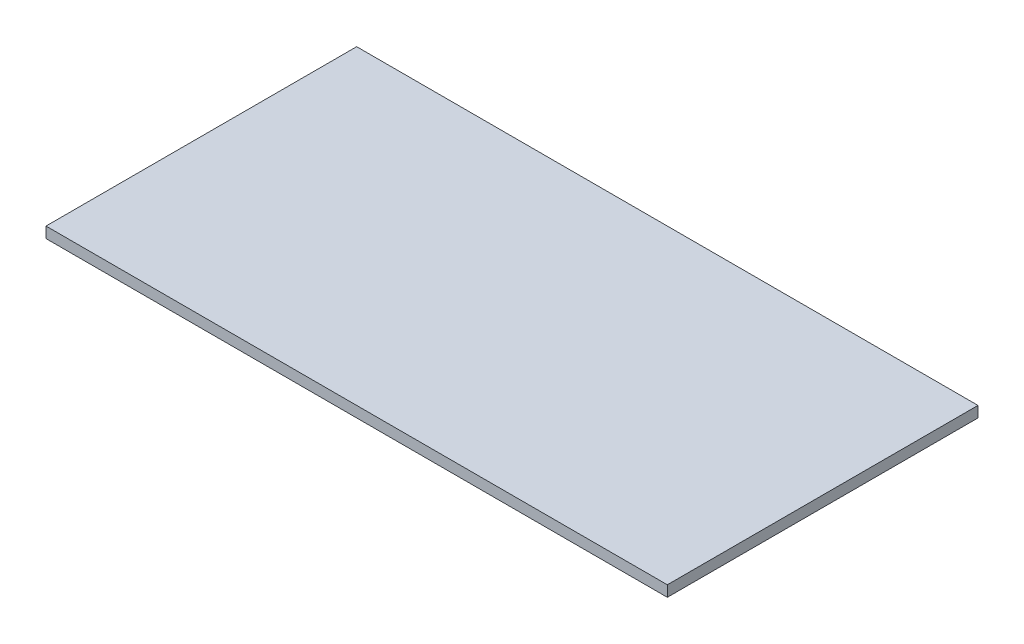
ISO-10303-21;
HEADER;
FILE_DESCRIPTION(('STEP AP214'),'2;1');
FILE_NAME('part.step','',(''),(''),'','','');
FILE_SCHEMA(('AUTOMOTIVE_DESIGN { 1 0 10303 214 1 1 1 1 }'));
ENDSEC;
DATA;
#1=APPLICATION_CONTEXT('core data for automotive mechanical design processes');
#2=APPLICATION_PROTOCOL_DEFINITION('international standard','automotive_design',2000,#1);
#3=PRODUCT_CONTEXT('',#1,'mechanical');
#4=PRODUCT('Part','Part','',(#3));
#5=PRODUCT_RELATED_PRODUCT_CATEGORY('part','',(#4));
#6=PRODUCT_DEFINITION_FORMATION('','',#4);
#7=PRODUCT_DEFINITION_CONTEXT('part definition',#1,'design');
#8=PRODUCT_DEFINITION('design','',#6,#7);
#9=PRODUCT_DEFINITION_SHAPE('','',#8);
#10=(LENGTH_UNIT() NAMED_UNIT(*) SI_UNIT(.MILLI.,.METRE.));
#11=(NAMED_UNIT(*) PLANE_ANGLE_UNIT() SI_UNIT($,.RADIAN.));
#12=(NAMED_UNIT(*) SI_UNIT($,.STERADIAN.) SOLID_ANGLE_UNIT());
#13=UNCERTAINTY_MEASURE_WITH_UNIT(LENGTH_MEASURE(1.E-05),#10,'distance_accuracy_value','');
#14=(GEOMETRIC_REPRESENTATION_CONTEXT(3) GLOBAL_UNCERTAINTY_ASSIGNED_CONTEXT((#13)) GLOBAL_UNIT_ASSIGNED_CONTEXT((#10,
#11,#12)) REPRESENTATION_CONTEXT('',''));
#15=CARTESIAN_POINT('',(0.,0.,0.));
#16=DIRECTION('',(0.,0.,1.));
#17=DIRECTION('',(1.,0.,0.));
#18=AXIS2_PLACEMENT_3D('',#15,#16,#17);
#19=CARTESIAN_POINT('',(-800.,28.,-400.));
#20=DIRECTION('',(1.,0.,0.));
#21=DIRECTION('',(0.,0.,-1.));
#22=AXIS2_PLACEMENT_3D('',#19,#20,#21);
#23=PLANE('',#22);
#24=DIRECTION('',(0.,0.,1.));
#25=VECTOR('',#24,1.);
#26=CARTESIAN_POINT('',(-800.,0.,-400.));
#27=LINE('',#26,#25);
#28=CARTESIAN_POINT('',(-800.,0.,-400.));
#29=VERTEX_POINT('',#28);
#30=CARTESIAN_POINT('',(-800.,0.,400.));
#31=VERTEX_POINT('',#30);
#32=EDGE_CURVE('E290',#29,#31,#27,.T.);
#33=ORIENTED_EDGE('',*,*,#32,.T.);
#34=DIRECTION('',(0.,-1.,0.));
#35=VECTOR('',#34,1.);
#36=CARTESIAN_POINT('',(-800.,28.,400.));
#37=LINE('',#36,#35);
#38=CARTESIAN_POINT('',(-800.,28.,400.));
#39=VERTEX_POINT('',#38);
#40=EDGE_CURVE('E11',#39,#31,#37,.T.);
#41=ORIENTED_EDGE('',*,*,#40,.F.);
#42=DIRECTION('',(0.,0.,1.));
#43=VECTOR('',#42,1.);
#44=CARTESIAN_POINT('',(-800.,28.,-400.));
#45=LINE('',#44,#43);
#46=CARTESIAN_POINT('',(-800.,28.,-400.));
#47=VERTEX_POINT('',#46);
#48=EDGE_CURVE('E291',#47,#39,#45,.T.);
#49=ORIENTED_EDGE('',*,*,#48,.F.);
#50=DIRECTION('',(0.,-1.,0.));
#51=VECTOR('',#50,1.);
#52=CARTESIAN_POINT('',(-800.,28.,-400.));
#53=LINE('',#52,#51);
#54=EDGE_CURVE('E297',#47,#29,#53,.T.);
#55=ORIENTED_EDGE('',*,*,#54,.T.);
#56=EDGE_LOOP('',(#33,#41,#49,#55));
#57=FACE_BOUND('',#56,.T.);
#58=ADVANCED_FACE('F42',(#57),#23,.F.);
#59=CARTESIAN_POINT('',(-800.,28.,400.));
#60=DIRECTION('',(0.,0.,-1.));
#61=DIRECTION('',(-1.,0.,0.));
#62=AXIS2_PLACEMENT_3D('',#59,#60,#61);
#63=PLANE('',#62);
#64=DIRECTION('',(1.,0.,0.));
#65=VECTOR('',#64,1.);
#66=CARTESIAN_POINT('',(-800.,0.,400.));
#67=LINE('',#66,#65);
#68=CARTESIAN_POINT('',(800.,0.,400.));
#69=VERTEX_POINT('',#68);
#70=EDGE_CURVE('E300',#31,#69,#67,.T.);
#71=ORIENTED_EDGE('',*,*,#70,.T.);
#72=DIRECTION('',(0.,-1.,0.));
#73=VECTOR('',#72,1.);
#74=CARTESIAN_POINT('',(800.,28.,400.));
#75=LINE('',#74,#73);
#76=CARTESIAN_POINT('',(800.,28.,400.));
#77=VERTEX_POINT('',#76);
#78=EDGE_CURVE('E50',#77,#69,#75,.T.);
#79=ORIENTED_EDGE('',*,*,#78,.F.);
#80=DIRECTION('',(1.,0.,0.));
#81=VECTOR('',#80,1.);
#82=CARTESIAN_POINT('',(-800.,28.,400.));
#83=LINE('',#82,#81);
#84=EDGE_CURVE('E89',#39,#77,#83,.T.);
#85=ORIENTED_EDGE('',*,*,#84,.F.);
#86=ORIENTED_EDGE('',*,*,#40,.T.);
#87=EDGE_LOOP('',(#71,#79,#85,#86));
#88=FACE_BOUND('',#87,.T.);
#89=ADVANCED_FACE('F323',(#88),#63,.F.);
#90=CARTESIAN_POINT('',(800.,28.,-400.));
#91=DIRECTION('',(-1.,0.,0.));
#92=DIRECTION('',(0.,0.,1.));
#93=AXIS2_PLACEMENT_3D('',#90,#91,#92);
#94=PLANE('',#93);
#95=DIRECTION('',(0.,0.,-1.));
#96=VECTOR('',#95,1.);
#97=CARTESIAN_POINT('',(800.,0.,-400.));
#98=LINE('',#97,#96);
#99=CARTESIAN_POINT('',(800.,0.,-400.));
#100=VERTEX_POINT('',#99);
#101=EDGE_CURVE('E76',#69,#100,#98,.T.);
#102=ORIENTED_EDGE('',*,*,#101,.T.);
#103=DIRECTION('',(0.,-1.,0.));
#104=VECTOR('',#103,1.);
#105=CARTESIAN_POINT('',(800.,28.,-400.));
#106=LINE('',#105,#104);
#107=CARTESIAN_POINT('',(800.,28.,-400.));
#108=VERTEX_POINT('',#107);
#109=EDGE_CURVE('E305',#108,#100,#106,.T.);
#110=ORIENTED_EDGE('',*,*,#109,.F.);
#111=DIRECTION('',(0.,0.,-1.));
#112=VECTOR('',#111,1.);
#113=CARTESIAN_POINT('',(800.,28.,-400.));
#114=LINE('',#113,#112);
#115=EDGE_CURVE('E294',#77,#108,#114,.T.);
#116=ORIENTED_EDGE('',*,*,#115,.F.);
#117=ORIENTED_EDGE('',*,*,#78,.T.);
#118=EDGE_LOOP('',(#102,#110,#116,#117));
#119=FACE_BOUND('',#118,.T.);
#120=ADVANCED_FACE('F307',(#119),#94,.F.);
#121=CARTESIAN_POINT('',(-800.,28.,-400.));
#122=DIRECTION('',(0.,0.,1.));
#123=DIRECTION('',(1.,0.,0.));
#124=AXIS2_PLACEMENT_3D('',#121,#122,#123);
#125=PLANE('',#124);
#126=DIRECTION('',(-1.,0.,0.));
#127=VECTOR('',#126,1.);
#128=CARTESIAN_POINT('',(-800.,0.,-400.));
#129=LINE('',#128,#127);
#130=EDGE_CURVE('E82',#100,#29,#129,.T.);
#131=ORIENTED_EDGE('',*,*,#130,.T.);
#132=ORIENTED_EDGE('',*,*,#54,.F.);
#133=DIRECTION('',(-1.,0.,0.));
#134=VECTOR('',#133,1.);
#135=CARTESIAN_POINT('',(-800.,28.,-400.));
#136=LINE('',#135,#134);
#137=EDGE_CURVE('E58',#108,#47,#136,.T.);
#138=ORIENTED_EDGE('',*,*,#137,.F.);
#139=ORIENTED_EDGE('',*,*,#109,.T.);
#140=EDGE_LOOP('',(#131,#132,#138,#139));
#141=FACE_BOUND('',#140,.T.);
#142=ADVANCED_FACE('F314',(#141),#125,.F.);
#143=CARTESIAN_POINT('',(0.,28.,0.));
#144=DIRECTION('',(0.,1.,0.));
#145=DIRECTION('',(0.,0.,1.));
#146=AXIS2_PLACEMENT_3D('',#143,#144,#145);
#147=PLANE('',#146);
#148=ORIENTED_EDGE('',*,*,#48,.T.);
#149=ORIENTED_EDGE('',*,*,#84,.T.);
#150=ORIENTED_EDGE('',*,*,#115,.T.);
#151=ORIENTED_EDGE('',*,*,#137,.T.);
#152=EDGE_LOOP('',(#148,#149,#150,#151));
#153=FACE_BOUND('',#152,.T.);
#154=ADVANCED_FACE('F316',(#153),#147,.T.);
#155=CARTESIAN_POINT('',(0.,0.,0.));
#156=DIRECTION('',(0.,1.,0.));
#157=DIRECTION('',(0.,0.,1.));
#158=AXIS2_PLACEMENT_3D('',#155,#156,#157);
#159=PLANE('',#158);
#160=CARTESIAN_POINT('',(-750.,0.,350.));
#161=DIRECTION('',(0.,-1.,0.));
#162=DIRECTION('',(0.,0.,-1.));
#163=AXIS2_PLACEMENT_3D('',#160,#161,#162);
#164=CIRCLE('',#163,6.49999999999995);
#165=CARTESIAN_POINT('',(-750.,0.,343.5));
#166=VERTEX_POINT('',#165);
#167=EDGE_CURVE('E155',#166,#166,#164,.T.);
#168=ORIENTED_EDGE('',*,*,#167,.F.);
#169=EDGE_LOOP('',(#168));
#170=FACE_BOUND('',#169,.T.);
#171=CARTESIAN_POINT('',(-750.,0.,50.));
#172=DIRECTION('',(0.,-1.,0.));
#173=DIRECTION('',(0.,0.,-1.));
#174=AXIS2_PLACEMENT_3D('',#171,#172,#173);
#175=CIRCLE('',#174,6.49999999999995);
#176=CARTESIAN_POINT('',(-750.,0.,43.5));
#177=VERTEX_POINT('',#176);
#178=EDGE_CURVE('E148',#177,#177,#175,.T.);
#179=ORIENTED_EDGE('',*,*,#178,.F.);
#180=EDGE_LOOP('',(#179));
#181=FACE_BOUND('',#180,.T.);
#182=CARTESIAN_POINT('',(-650.,0.,350.));
#183=DIRECTION('',(0.,-1.,0.));
#184=DIRECTION('',(0.,0.,-1.));
#185=AXIS2_PLACEMENT_3D('',#182,#183,#184);
#186=CIRCLE('',#185,6.49999999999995);
#187=CARTESIAN_POINT('',(-650.,0.,343.5));
#188=VERTEX_POINT('',#187);
#189=EDGE_CURVE('E164',#188,#188,#186,.T.);
#190=ORIENTED_EDGE('',*,*,#189,.F.);
#191=EDGE_LOOP('',(#190));
#192=FACE_BOUND('',#191,.T.);
#193=CARTESIAN_POINT('',(-650.,0.,50.));
#194=DIRECTION('',(0.,-1.,0.));
#195=DIRECTION('',(0.,0.,-1.));
#196=AXIS2_PLACEMENT_3D('',#193,#194,#195);
#197=CIRCLE('',#196,6.49999999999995);
#198=CARTESIAN_POINT('',(-650.,0.,43.5));
#199=VERTEX_POINT('',#198);
#200=EDGE_CURVE('E173',#199,#199,#197,.T.);
#201=ORIENTED_EDGE('',*,*,#200,.F.);
#202=EDGE_LOOP('',(#201));
#203=FACE_BOUND('',#202,.T.);
#204=CARTESIAN_POINT('',(-650.,0.,-50.));
#205=DIRECTION('',(0.,-1.,0.));
#206=DIRECTION('',(0.,0.,-1.));
#207=AXIS2_PLACEMENT_3D('',#204,#205,#206);
#208=CIRCLE('',#207,6.49999999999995);
#209=CARTESIAN_POINT('',(-650.,0.,-56.4999999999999));
#210=VERTEX_POINT('',#209);
#211=EDGE_CURVE('E182',#210,#210,#208,.T.);
#212=ORIENTED_EDGE('',*,*,#211,.F.);
#213=EDGE_LOOP('',(#212));
#214=FACE_BOUND('',#213,.T.);
#215=CARTESIAN_POINT('',(-650.,0.,-350.));
#216=DIRECTION('',(0.,-1.,0.));
#217=DIRECTION('',(0.,0.,-1.));
#218=AXIS2_PLACEMENT_3D('',#215,#216,#217);
#219=CIRCLE('',#218,6.49999999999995);
#220=CARTESIAN_POINT('',(-650.,0.,-356.5));
#221=VERTEX_POINT('',#220);
#222=EDGE_CURVE('E191',#221,#221,#219,.T.);
#223=ORIENTED_EDGE('',*,*,#222,.F.);
#224=EDGE_LOOP('',(#223));
#225=FACE_BOUND('',#224,.T.);
#226=CARTESIAN_POINT('',(-750.,0.,-50.));
#227=DIRECTION('',(0.,-1.,0.));
#228=DIRECTION('',(0.,0.,-1.));
#229=AXIS2_PLACEMENT_3D('',#226,#227,#228);
#230=CIRCLE('',#229,6.49999999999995);
#231=CARTESIAN_POINT('',(-750.,0.,-56.4999999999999));
#232=VERTEX_POINT('',#231);
#233=EDGE_CURVE('E200',#232,#232,#230,.T.);
#234=ORIENTED_EDGE('',*,*,#233,.F.);
#235=EDGE_LOOP('',(#234));
#236=FACE_BOUND('',#235,.T.);
#237=CARTESIAN_POINT('',(-750.,0.,-350.));
#238=DIRECTION('',(0.,-1.,0.));
#239=DIRECTION('',(0.,0.,-1.));
#240=AXIS2_PLACEMENT_3D('',#237,#238,#239);
#241=CIRCLE('',#240,6.49999999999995);
#242=CARTESIAN_POINT('',(-750.,0.,-356.5));
#243=VERTEX_POINT('',#242);
#244=EDGE_CURVE('E209',#243,#243,#241,.T.);
#245=ORIENTED_EDGE('',*,*,#244,.F.);
#246=EDGE_LOOP('',(#245));
#247=FACE_BOUND('',#246,.T.);
#248=CARTESIAN_POINT('',(750.,0.,350.));
#249=DIRECTION('',(0.,-1.,0.));
#250=DIRECTION('',(0.,0.,-1.));
#251=AXIS2_PLACEMENT_3D('',#248,#249,#250);
#252=CIRCLE('',#251,6.49999999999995);
#253=CARTESIAN_POINT('',(750.,0.,343.5));
#254=VERTEX_POINT('',#253);
#255=EDGE_CURVE('E218',#254,#254,#252,.T.);
#256=ORIENTED_EDGE('',*,*,#255,.F.);
#257=EDGE_LOOP('',(#256));
#258=FACE_BOUND('',#257,.T.);
#259=CARTESIAN_POINT('',(750.,0.,50.));
#260=DIRECTION('',(0.,-1.,0.));
#261=DIRECTION('',(0.,0.,-1.));
#262=AXIS2_PLACEMENT_3D('',#259,#260,#261);
#263=CIRCLE('',#262,6.49999999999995);
#264=CARTESIAN_POINT('',(750.,0.,43.5));
#265=VERTEX_POINT('',#264);
#266=EDGE_CURVE('E227',#265,#265,#263,.T.);
#267=ORIENTED_EDGE('',*,*,#266,.F.);
#268=EDGE_LOOP('',(#267));
#269=FACE_BOUND('',#268,.T.);
#270=CARTESIAN_POINT('',(650.,0.,50.));
#271=DIRECTION('',(0.,-1.,0.));
#272=DIRECTION('',(0.,0.,-1.));
#273=AXIS2_PLACEMENT_3D('',#270,#271,#272);
#274=CIRCLE('',#273,6.49999999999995);
#275=CARTESIAN_POINT('',(650.,0.,43.5));
#276=VERTEX_POINT('',#275);
#277=EDGE_CURVE('E236',#276,#276,#274,.T.);
#278=ORIENTED_EDGE('',*,*,#277,.F.);
#279=EDGE_LOOP('',(#278));
#280=FACE_BOUND('',#279,.T.);
#281=CARTESIAN_POINT('',(650.,0.,350.));
#282=DIRECTION('',(0.,-1.,0.));
#283=DIRECTION('',(0.,0.,-1.));
#284=AXIS2_PLACEMENT_3D('',#281,#282,#283);
#285=CIRCLE('',#284,6.49999999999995);
#286=CARTESIAN_POINT('',(650.,0.,343.5));
#287=VERTEX_POINT('',#286);
#288=EDGE_CURVE('E245',#287,#287,#285,.T.);
#289=ORIENTED_EDGE('',*,*,#288,.F.);
#290=EDGE_LOOP('',(#289));
#291=FACE_BOUND('',#290,.T.);
#292=CARTESIAN_POINT('',(750.,0.,-50.));
#293=DIRECTION('',(0.,-1.,0.));
#294=DIRECTION('',(0.,0.,-1.));
#295=AXIS2_PLACEMENT_3D('',#292,#293,#294);
#296=CIRCLE('',#295,6.49999999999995);
#297=CARTESIAN_POINT('',(750.,0.,-56.4999999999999));
#298=VERTEX_POINT('',#297);
#299=EDGE_CURVE('E254',#298,#298,#296,.T.);
#300=ORIENTED_EDGE('',*,*,#299,.F.);
#301=EDGE_LOOP('',(#300));
#302=FACE_BOUND('',#301,.T.);
#303=CARTESIAN_POINT('',(750.,0.,-350.));
#304=DIRECTION('',(0.,-1.,0.));
#305=DIRECTION('',(0.,0.,-1.));
#306=AXIS2_PLACEMENT_3D('',#303,#304,#305);
#307=CIRCLE('',#306,6.49999999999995);
#308=CARTESIAN_POINT('',(750.,0.,-356.5));
#309=VERTEX_POINT('',#308);
#310=EDGE_CURVE('E263',#309,#309,#307,.T.);
#311=ORIENTED_EDGE('',*,*,#310,.F.);
#312=EDGE_LOOP('',(#311));
#313=FACE_BOUND('',#312,.T.);
#314=CARTESIAN_POINT('',(650.,0.,-350.));
#315=DIRECTION('',(0.,-1.,0.));
#316=DIRECTION('',(0.,0.,-1.));
#317=AXIS2_PLACEMENT_3D('',#314,#315,#316);
#318=CIRCLE('',#317,6.49999999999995);
#319=CARTESIAN_POINT('',(650.,0.,-356.5));
#320=VERTEX_POINT('',#319);
#321=EDGE_CURVE('E272',#320,#320,#318,.T.);
#322=ORIENTED_EDGE('',*,*,#321,.F.);
#323=EDGE_LOOP('',(#322));
#324=FACE_BOUND('',#323,.T.);
#325=CARTESIAN_POINT('',(650.,0.,-50.));
#326=DIRECTION('',(0.,-1.,0.));
#327=DIRECTION('',(0.,0.,-1.));
#328=AXIS2_PLACEMENT_3D('',#325,#326,#327);
#329=CIRCLE('',#328,6.49999999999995);
#330=CARTESIAN_POINT('',(650.,0.,-56.4999999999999));
#331=VERTEX_POINT('',#330);
#332=EDGE_CURVE('E281',#331,#331,#329,.T.);
#333=ORIENTED_EDGE('',*,*,#332,.F.);
#334=EDGE_LOOP('',(#333));
#335=FACE_BOUND('',#334,.T.);
#336=ORIENTED_EDGE('',*,*,#32,.F.);
#337=ORIENTED_EDGE('',*,*,#130,.F.);
#338=ORIENTED_EDGE('',*,*,#101,.F.);
#339=ORIENTED_EDGE('',*,*,#70,.F.);
#340=EDGE_LOOP('',(#336,#337,#338,#339));
#341=FACE_BOUND('',#340,.T.);
#342=ADVANCED_FACE('F310',(#170,#181,#192,#203,#214,#225,#236,#247,#258,#269,#280,#291,#302,
#313,#324,#335,#341),#159,.F.);
#343=CARTESIAN_POINT('',(650.,20.,-50.));
#344=DIRECTION('',(0.,-1.,0.));
#345=DIRECTION('',(0.,0.,-1.));
#346=AXIS2_PLACEMENT_3D('',#343,#344,#345);
#347=CONICAL_SURFACE('',#346,4.,1.02974425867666);
#348=CARTESIAN_POINT('',(650.,22.4034424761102,-50.));
#349=VERTEX_POINT('',#348);
#350=VERTEX_LOOP('',#349);
#351=FACE_BOUND('',#350,.T.);
#352=CARTESIAN_POINT('',(650.,20.,-50.));
#353=DIRECTION('',(0.,-1.,0.));
#354=DIRECTION('',(0.,0.,-1.));
#355=AXIS2_PLACEMENT_3D('',#352,#353,#354);
#356=CIRCLE('',#355,4.);
#357=CARTESIAN_POINT('',(650.,20.,-54.));
#358=VERTEX_POINT('',#357);
#359=EDGE_CURVE('E287',#358,#358,#356,.T.);
#360=ORIENTED_EDGE('',*,*,#359,.T.);
#361=EDGE_LOOP('',(#360));
#362=FACE_BOUND('',#361,.T.);
#363=ADVANCED_FACE('F358',(#351,#362),#347,.F.);
#364=CARTESIAN_POINT('',(650.,0.,-50.));
#365=DIRECTION('',(0.,-1.,0.));
#366=DIRECTION('',(0.,0.,-1.));
#367=AXIS2_PLACEMENT_3D('',#364,#365,#366);
#368=CYLINDRICAL_SURFACE('',#367,4.);
#369=ORIENTED_EDGE('',*,*,#359,.F.);
#370=EDGE_LOOP('',(#369));
#371=FACE_BOUND('',#370,.T.);
#372=CARTESIAN_POINT('',(650.,2.5,-50.));
#373=DIRECTION('',(0.,-1.,0.));
#374=DIRECTION('',(0.,0.,-1.));
#375=AXIS2_PLACEMENT_3D('',#372,#373,#374);
#376=CIRCLE('',#375,4.);
#377=CARTESIAN_POINT('',(650.,2.5,-54.));
#378=VERTEX_POINT('',#377);
#379=EDGE_CURVE('E284',#378,#378,#376,.T.);
#380=ORIENTED_EDGE('',*,*,#379,.T.);
#381=EDGE_LOOP('',(#380));
#382=FACE_BOUND('',#381,.T.);
#383=ADVANCED_FACE('F368',(#371,#382),#368,.F.);
#384=CARTESIAN_POINT('',(650.,0.,-50.));
#385=DIRECTION('',(0.,-1.,0.));
#386=DIRECTION('',(0.,0.,-1.));
#387=AXIS2_PLACEMENT_3D('',#384,#385,#386);
#388=CONICAL_SURFACE('',#387,6.49999999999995,0.785398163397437);
#389=ORIENTED_EDGE('',*,*,#379,.F.);
#390=EDGE_LOOP('',(#389));
#391=FACE_BOUND('',#390,.T.);
#392=ORIENTED_EDGE('',*,*,#332,.T.);
#393=EDGE_LOOP('',(#392));
#394=FACE_BOUND('',#393,.T.);
#395=ADVANCED_FACE('F379',(#391,#394),#388,.F.);
#396=CARTESIAN_POINT('',(650.,20.,-350.));
#397=DIRECTION('',(0.,-1.,0.));
#398=DIRECTION('',(0.,0.,-1.));
#399=AXIS2_PLACEMENT_3D('',#396,#397,#398);
#400=CONICAL_SURFACE('',#399,4.,1.02974425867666);
#401=CARTESIAN_POINT('',(650.,22.4034424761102,-350.));
#402=VERTEX_POINT('',#401);
#403=VERTEX_LOOP('',#402);
#404=FACE_BOUND('',#403,.T.);
#405=CARTESIAN_POINT('',(650.,20.,-350.));
#406=DIRECTION('',(0.,-1.,0.));
#407=DIRECTION('',(0.,0.,-1.));
#408=AXIS2_PLACEMENT_3D('',#405,#406,#407);
#409=CIRCLE('',#408,4.);
#410=CARTESIAN_POINT('',(650.,20.,-354.));
#411=VERTEX_POINT('',#410);
#412=EDGE_CURVE('E278',#411,#411,#409,.T.);
#413=ORIENTED_EDGE('',*,*,#412,.T.);
#414=EDGE_LOOP('',(#413));
#415=FACE_BOUND('',#414,.T.);
#416=ADVANCED_FACE('F390',(#404,#415),#400,.F.);
#417=CARTESIAN_POINT('',(650.,0.,-350.));
#418=DIRECTION('',(0.,-1.,0.));
#419=DIRECTION('',(0.,0.,-1.));
#420=AXIS2_PLACEMENT_3D('',#417,#418,#419);
#421=CYLINDRICAL_SURFACE('',#420,4.);
#422=ORIENTED_EDGE('',*,*,#412,.F.);
#423=EDGE_LOOP('',(#422));
#424=FACE_BOUND('',#423,.T.);
#425=CARTESIAN_POINT('',(650.,2.5,-350.));
#426=DIRECTION('',(0.,-1.,0.));
#427=DIRECTION('',(0.,0.,-1.));
#428=AXIS2_PLACEMENT_3D('',#425,#426,#427);
#429=CIRCLE('',#428,4.);
#430=CARTESIAN_POINT('',(650.,2.5,-354.));
#431=VERTEX_POINT('',#430);
#432=EDGE_CURVE('E275',#431,#431,#429,.T.);
#433=ORIENTED_EDGE('',*,*,#432,.T.);
#434=EDGE_LOOP('',(#433));
#435=FACE_BOUND('',#434,.T.);
#436=ADVANCED_FACE('F401',(#424,#435),#421,.F.);
#437=CARTESIAN_POINT('',(650.,0.,-350.));
#438=DIRECTION('',(0.,-1.,0.));
#439=DIRECTION('',(0.,0.,-1.));
#440=AXIS2_PLACEMENT_3D('',#437,#438,#439);
#441=CONICAL_SURFACE('',#440,6.49999999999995,0.785398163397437);
#442=ORIENTED_EDGE('',*,*,#432,.F.);
#443=EDGE_LOOP('',(#442));
#444=FACE_BOUND('',#443,.T.);
#445=ORIENTED_EDGE('',*,*,#321,.T.);
#446=EDGE_LOOP('',(#445));
#447=FACE_BOUND('',#446,.T.);
#448=ADVANCED_FACE('F412',(#444,#447),#441,.F.);
#449=CARTESIAN_POINT('',(750.,20.,-350.));
#450=DIRECTION('',(0.,-1.,0.));
#451=DIRECTION('',(0.,0.,-1.));
#452=AXIS2_PLACEMENT_3D('',#449,#450,#451);
#453=CONICAL_SURFACE('',#452,4.,1.02974425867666);
#454=CARTESIAN_POINT('',(750.,22.4034424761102,-350.));
#455=VERTEX_POINT('',#454);
#456=VERTEX_LOOP('',#455);
#457=FACE_BOUND('',#456,.T.);
#458=CARTESIAN_POINT('',(750.,20.,-350.));
#459=DIRECTION('',(0.,-1.,0.));
#460=DIRECTION('',(0.,0.,-1.));
#461=AXIS2_PLACEMENT_3D('',#458,#459,#460);
#462=CIRCLE('',#461,4.);
#463=CARTESIAN_POINT('',(750.,20.,-354.));
#464=VERTEX_POINT('',#463);
#465=EDGE_CURVE('E269',#464,#464,#462,.T.);
#466=ORIENTED_EDGE('',*,*,#465,.T.);
#467=EDGE_LOOP('',(#466));
#468=FACE_BOUND('',#467,.T.);
#469=ADVANCED_FACE('F423',(#457,#468),#453,.F.);
#470=CARTESIAN_POINT('',(750.,0.,-350.));
#471=DIRECTION('',(0.,-1.,0.));
#472=DIRECTION('',(0.,0.,-1.));
#473=AXIS2_PLACEMENT_3D('',#470,#471,#472);
#474=CYLINDRICAL_SURFACE('',#473,4.);
#475=ORIENTED_EDGE('',*,*,#465,.F.);
#476=EDGE_LOOP('',(#475));
#477=FACE_BOUND('',#476,.T.);
#478=CARTESIAN_POINT('',(750.,2.5,-350.));
#479=DIRECTION('',(0.,-1.,0.));
#480=DIRECTION('',(0.,0.,-1.));
#481=AXIS2_PLACEMENT_3D('',#478,#479,#480);
#482=CIRCLE('',#481,4.);
#483=CARTESIAN_POINT('',(750.,2.5,-354.));
#484=VERTEX_POINT('',#483);
#485=EDGE_CURVE('E266',#484,#484,#482,.T.);
#486=ORIENTED_EDGE('',*,*,#485,.T.);
#487=EDGE_LOOP('',(#486));
#488=FACE_BOUND('',#487,.T.);
#489=ADVANCED_FACE('F434',(#477,#488),#474,.F.);
#490=CARTESIAN_POINT('',(750.,0.,-350.));
#491=DIRECTION('',(0.,-1.,0.));
#492=DIRECTION('',(0.,0.,-1.));
#493=AXIS2_PLACEMENT_3D('',#490,#491,#492);
#494=CONICAL_SURFACE('',#493,6.49999999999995,0.785398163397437);
#495=ORIENTED_EDGE('',*,*,#485,.F.);
#496=EDGE_LOOP('',(#495));
#497=FACE_BOUND('',#496,.T.);
#498=ORIENTED_EDGE('',*,*,#310,.T.);
#499=EDGE_LOOP('',(#498));
#500=FACE_BOUND('',#499,.T.);
#501=ADVANCED_FACE('F445',(#497,#500),#494,.F.);
#502=CARTESIAN_POINT('',(750.,20.,-50.));
#503=DIRECTION('',(0.,-1.,0.));
#504=DIRECTION('',(0.,0.,-1.));
#505=AXIS2_PLACEMENT_3D('',#502,#503,#504);
#506=CONICAL_SURFACE('',#505,4.,1.02974425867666);
#507=CARTESIAN_POINT('',(750.,22.4034424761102,-50.));
#508=VERTEX_POINT('',#507);
#509=VERTEX_LOOP('',#508);
#510=FACE_BOUND('',#509,.T.);
#511=CARTESIAN_POINT('',(750.,20.,-50.));
#512=DIRECTION('',(0.,-1.,0.));
#513=DIRECTION('',(0.,0.,-1.));
#514=AXIS2_PLACEMENT_3D('',#511,#512,#513);
#515=CIRCLE('',#514,4.);
#516=CARTESIAN_POINT('',(750.,20.,-54.));
#517=VERTEX_POINT('',#516);
#518=EDGE_CURVE('E260',#517,#517,#515,.T.);
#519=ORIENTED_EDGE('',*,*,#518,.T.);
#520=EDGE_LOOP('',(#519));
#521=FACE_BOUND('',#520,.T.);
#522=ADVANCED_FACE('F456',(#510,#521),#506,.F.);
#523=CARTESIAN_POINT('',(750.,0.,-50.));
#524=DIRECTION('',(0.,-1.,0.));
#525=DIRECTION('',(0.,0.,-1.));
#526=AXIS2_PLACEMENT_3D('',#523,#524,#525);
#527=CYLINDRICAL_SURFACE('',#526,4.);
#528=ORIENTED_EDGE('',*,*,#518,.F.);
#529=EDGE_LOOP('',(#528));
#530=FACE_BOUND('',#529,.T.);
#531=CARTESIAN_POINT('',(750.,2.5,-50.));
#532=DIRECTION('',(0.,-1.,0.));
#533=DIRECTION('',(0.,0.,-1.));
#534=AXIS2_PLACEMENT_3D('',#531,#532,#533);
#535=CIRCLE('',#534,4.);
#536=CARTESIAN_POINT('',(750.,2.5,-54.));
#537=VERTEX_POINT('',#536);
#538=EDGE_CURVE('E257',#537,#537,#535,.T.);
#539=ORIENTED_EDGE('',*,*,#538,.T.);
#540=EDGE_LOOP('',(#539));
#541=FACE_BOUND('',#540,.T.);
#542=ADVANCED_FACE('F467',(#530,#541),#527,.F.);
#543=CARTESIAN_POINT('',(750.,0.,-50.));
#544=DIRECTION('',(0.,-1.,0.));
#545=DIRECTION('',(0.,0.,-1.));
#546=AXIS2_PLACEMENT_3D('',#543,#544,#545);
#547=CONICAL_SURFACE('',#546,6.49999999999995,0.785398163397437);
#548=ORIENTED_EDGE('',*,*,#538,.F.);
#549=EDGE_LOOP('',(#548));
#550=FACE_BOUND('',#549,.T.);
#551=ORIENTED_EDGE('',*,*,#299,.T.);
#552=EDGE_LOOP('',(#551));
#553=FACE_BOUND('',#552,.T.);
#554=ADVANCED_FACE('F478',(#550,#553),#547,.F.);
#555=CARTESIAN_POINT('',(650.,20.,350.));
#556=DIRECTION('',(0.,-1.,0.));
#557=DIRECTION('',(0.,0.,-1.));
#558=AXIS2_PLACEMENT_3D('',#555,#556,#557);
#559=CONICAL_SURFACE('',#558,4.,1.02974425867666);
#560=CARTESIAN_POINT('',(650.,22.4034424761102,350.));
#561=VERTEX_POINT('',#560);
#562=VERTEX_LOOP('',#561);
#563=FACE_BOUND('',#562,.T.);
#564=CARTESIAN_POINT('',(650.,20.,350.));
#565=DIRECTION('',(0.,-1.,0.));
#566=DIRECTION('',(0.,0.,-1.));
#567=AXIS2_PLACEMENT_3D('',#564,#565,#566);
#568=CIRCLE('',#567,4.);
#569=CARTESIAN_POINT('',(650.,20.,346.));
#570=VERTEX_POINT('',#569);
#571=EDGE_CURVE('E251',#570,#570,#568,.T.);
#572=ORIENTED_EDGE('',*,*,#571,.T.);
#573=EDGE_LOOP('',(#572));
#574=FACE_BOUND('',#573,.T.);
#575=ADVANCED_FACE('F489',(#563,#574),#559,.F.);
#576=CARTESIAN_POINT('',(650.,0.,350.));
#577=DIRECTION('',(0.,-1.,0.));
#578=DIRECTION('',(0.,0.,-1.));
#579=AXIS2_PLACEMENT_3D('',#576,#577,#578);
#580=CYLINDRICAL_SURFACE('',#579,4.);
#581=ORIENTED_EDGE('',*,*,#571,.F.);
#582=EDGE_LOOP('',(#581));
#583=FACE_BOUND('',#582,.T.);
#584=CARTESIAN_POINT('',(650.,2.5,350.));
#585=DIRECTION('',(0.,-1.,0.));
#586=DIRECTION('',(0.,0.,-1.));
#587=AXIS2_PLACEMENT_3D('',#584,#585,#586);
#588=CIRCLE('',#587,4.);
#589=CARTESIAN_POINT('',(650.,2.5,346.));
#590=VERTEX_POINT('',#589);
#591=EDGE_CURVE('E248',#590,#590,#588,.T.);
#592=ORIENTED_EDGE('',*,*,#591,.T.);
#593=EDGE_LOOP('',(#592));
#594=FACE_BOUND('',#593,.T.);
#595=ADVANCED_FACE('F500',(#583,#594),#580,.F.);
#596=CARTESIAN_POINT('',(650.,0.,350.));
#597=DIRECTION('',(0.,-1.,0.));
#598=DIRECTION('',(0.,0.,-1.));
#599=AXIS2_PLACEMENT_3D('',#596,#597,#598);
#600=CONICAL_SURFACE('',#599,6.49999999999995,0.785398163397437);
#601=ORIENTED_EDGE('',*,*,#591,.F.);
#602=EDGE_LOOP('',(#601));
#603=FACE_BOUND('',#602,.T.);
#604=ORIENTED_EDGE('',*,*,#288,.T.);
#605=EDGE_LOOP('',(#604));
#606=FACE_BOUND('',#605,.T.);
#607=ADVANCED_FACE('F511',(#603,#606),#600,.F.);
#608=CARTESIAN_POINT('',(650.,20.,50.));
#609=DIRECTION('',(0.,-1.,0.));
#610=DIRECTION('',(0.,0.,-1.));
#611=AXIS2_PLACEMENT_3D('',#608,#609,#610);
#612=CONICAL_SURFACE('',#611,4.,1.02974425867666);
#613=CARTESIAN_POINT('',(650.,22.4034424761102,50.));
#614=VERTEX_POINT('',#613);
#615=VERTEX_LOOP('',#614);
#616=FACE_BOUND('',#615,.T.);
#617=CARTESIAN_POINT('',(650.,20.,50.));
#618=DIRECTION('',(0.,-1.,0.));
#619=DIRECTION('',(0.,0.,-1.));
#620=AXIS2_PLACEMENT_3D('',#617,#618,#619);
#621=CIRCLE('',#620,4.);
#622=CARTESIAN_POINT('',(650.,20.,46.));
#623=VERTEX_POINT('',#622);
#624=EDGE_CURVE('E242',#623,#623,#621,.T.);
#625=ORIENTED_EDGE('',*,*,#624,.T.);
#626=EDGE_LOOP('',(#625));
#627=FACE_BOUND('',#626,.T.);
#628=ADVANCED_FACE('F522',(#616,#627),#612,.F.);
#629=CARTESIAN_POINT('',(650.,0.,50.));
#630=DIRECTION('',(0.,-1.,0.));
#631=DIRECTION('',(0.,0.,-1.));
#632=AXIS2_PLACEMENT_3D('',#629,#630,#631);
#633=CYLINDRICAL_SURFACE('',#632,4.);
#634=ORIENTED_EDGE('',*,*,#624,.F.);
#635=EDGE_LOOP('',(#634));
#636=FACE_BOUND('',#635,.T.);
#637=CARTESIAN_POINT('',(650.,2.5,50.));
#638=DIRECTION('',(0.,-1.,0.));
#639=DIRECTION('',(0.,0.,-1.));
#640=AXIS2_PLACEMENT_3D('',#637,#638,#639);
#641=CIRCLE('',#640,4.);
#642=CARTESIAN_POINT('',(650.,2.5,46.));
#643=VERTEX_POINT('',#642);
#644=EDGE_CURVE('E239',#643,#643,#641,.T.);
#645=ORIENTED_EDGE('',*,*,#644,.T.);
#646=EDGE_LOOP('',(#645));
#647=FACE_BOUND('',#646,.T.);
#648=ADVANCED_FACE('F533',(#636,#647),#633,.F.);
#649=CARTESIAN_POINT('',(650.,0.,50.));
#650=DIRECTION('',(0.,-1.,0.));
#651=DIRECTION('',(0.,0.,-1.));
#652=AXIS2_PLACEMENT_3D('',#649,#650,#651);
#653=CONICAL_SURFACE('',#652,6.49999999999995,0.785398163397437);
#654=ORIENTED_EDGE('',*,*,#644,.F.);
#655=EDGE_LOOP('',(#654));
#656=FACE_BOUND('',#655,.T.);
#657=ORIENTED_EDGE('',*,*,#277,.T.);
#658=EDGE_LOOP('',(#657));
#659=FACE_BOUND('',#658,.T.);
#660=ADVANCED_FACE('F544',(#656,#659),#653,.F.);
#661=CARTESIAN_POINT('',(750.,20.,50.));
#662=DIRECTION('',(0.,-1.,0.));
#663=DIRECTION('',(0.,0.,-1.));
#664=AXIS2_PLACEMENT_3D('',#661,#662,#663);
#665=CONICAL_SURFACE('',#664,4.,1.02974425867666);
#666=CARTESIAN_POINT('',(750.,22.4034424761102,50.));
#667=VERTEX_POINT('',#666);
#668=VERTEX_LOOP('',#667);
#669=FACE_BOUND('',#668,.T.);
#670=CARTESIAN_POINT('',(750.,20.,50.));
#671=DIRECTION('',(0.,-1.,0.));
#672=DIRECTION('',(0.,0.,-1.));
#673=AXIS2_PLACEMENT_3D('',#670,#671,#672);
#674=CIRCLE('',#673,4.);
#675=CARTESIAN_POINT('',(750.,20.,46.));
#676=VERTEX_POINT('',#675);
#677=EDGE_CURVE('E233',#676,#676,#674,.T.);
#678=ORIENTED_EDGE('',*,*,#677,.T.);
#679=EDGE_LOOP('',(#678));
#680=FACE_BOUND('',#679,.T.);
#681=ADVANCED_FACE('F555',(#669,#680),#665,.F.);
#682=CARTESIAN_POINT('',(750.,0.,50.));
#683=DIRECTION('',(0.,-1.,0.));
#684=DIRECTION('',(0.,0.,-1.));
#685=AXIS2_PLACEMENT_3D('',#682,#683,#684);
#686=CYLINDRICAL_SURFACE('',#685,4.);
#687=ORIENTED_EDGE('',*,*,#677,.F.);
#688=EDGE_LOOP('',(#687));
#689=FACE_BOUND('',#688,.T.);
#690=CARTESIAN_POINT('',(750.,2.5,50.));
#691=DIRECTION('',(0.,-1.,0.));
#692=DIRECTION('',(0.,0.,-1.));
#693=AXIS2_PLACEMENT_3D('',#690,#691,#692);
#694=CIRCLE('',#693,4.);
#695=CARTESIAN_POINT('',(750.,2.5,46.));
#696=VERTEX_POINT('',#695);
#697=EDGE_CURVE('E230',#696,#696,#694,.T.);
#698=ORIENTED_EDGE('',*,*,#697,.T.);
#699=EDGE_LOOP('',(#698));
#700=FACE_BOUND('',#699,.T.);
#701=ADVANCED_FACE('F566',(#689,#700),#686,.F.);
#702=CARTESIAN_POINT('',(750.,0.,50.));
#703=DIRECTION('',(0.,-1.,0.));
#704=DIRECTION('',(0.,0.,-1.));
#705=AXIS2_PLACEMENT_3D('',#702,#703,#704);
#706=CONICAL_SURFACE('',#705,6.49999999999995,0.785398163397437);
#707=ORIENTED_EDGE('',*,*,#697,.F.);
#708=EDGE_LOOP('',(#707));
#709=FACE_BOUND('',#708,.T.);
#710=ORIENTED_EDGE('',*,*,#266,.T.);
#711=EDGE_LOOP('',(#710));
#712=FACE_BOUND('',#711,.T.);
#713=ADVANCED_FACE('F577',(#709,#712),#706,.F.);
#714=CARTESIAN_POINT('',(750.,20.,350.));
#715=DIRECTION('',(0.,-1.,0.));
#716=DIRECTION('',(0.,0.,-1.));
#717=AXIS2_PLACEMENT_3D('',#714,#715,#716);
#718=CONICAL_SURFACE('',#717,4.,1.02974425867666);
#719=CARTESIAN_POINT('',(750.,22.4034424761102,350.));
#720=VERTEX_POINT('',#719);
#721=VERTEX_LOOP('',#720);
#722=FACE_BOUND('',#721,.T.);
#723=CARTESIAN_POINT('',(750.,20.,350.));
#724=DIRECTION('',(0.,-1.,0.));
#725=DIRECTION('',(0.,0.,-1.));
#726=AXIS2_PLACEMENT_3D('',#723,#724,#725);
#727=CIRCLE('',#726,4.);
#728=CARTESIAN_POINT('',(750.,20.,346.));
#729=VERTEX_POINT('',#728);
#730=EDGE_CURVE('E224',#729,#729,#727,.T.);
#731=ORIENTED_EDGE('',*,*,#730,.T.);
#732=EDGE_LOOP('',(#731));
#733=FACE_BOUND('',#732,.T.);
#734=ADVANCED_FACE('F588',(#722,#733),#718,.F.);
#735=CARTESIAN_POINT('',(750.,0.,350.));
#736=DIRECTION('',(0.,-1.,0.));
#737=DIRECTION('',(0.,0.,-1.));
#738=AXIS2_PLACEMENT_3D('',#735,#736,#737);
#739=CYLINDRICAL_SURFACE('',#738,4.);
#740=ORIENTED_EDGE('',*,*,#730,.F.);
#741=EDGE_LOOP('',(#740));
#742=FACE_BOUND('',#741,.T.);
#743=CARTESIAN_POINT('',(750.,2.5,350.));
#744=DIRECTION('',(0.,-1.,0.));
#745=DIRECTION('',(0.,0.,-1.));
#746=AXIS2_PLACEMENT_3D('',#743,#744,#745);
#747=CIRCLE('',#746,4.);
#748=CARTESIAN_POINT('',(750.,2.5,346.));
#749=VERTEX_POINT('',#748);
#750=EDGE_CURVE('E221',#749,#749,#747,.T.);
#751=ORIENTED_EDGE('',*,*,#750,.T.);
#752=EDGE_LOOP('',(#751));
#753=FACE_BOUND('',#752,.T.);
#754=ADVANCED_FACE('F599',(#742,#753),#739,.F.);
#755=CARTESIAN_POINT('',(750.,0.,350.));
#756=DIRECTION('',(0.,-1.,0.));
#757=DIRECTION('',(0.,0.,-1.));
#758=AXIS2_PLACEMENT_3D('',#755,#756,#757);
#759=CONICAL_SURFACE('',#758,6.49999999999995,0.785398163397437);
#760=ORIENTED_EDGE('',*,*,#750,.F.);
#761=EDGE_LOOP('',(#760));
#762=FACE_BOUND('',#761,.T.);
#763=ORIENTED_EDGE('',*,*,#255,.T.);
#764=EDGE_LOOP('',(#763));
#765=FACE_BOUND('',#764,.T.);
#766=ADVANCED_FACE('F610',(#762,#765),#759,.F.);
#767=CARTESIAN_POINT('',(-750.,20.,-350.));
#768=DIRECTION('',(0.,-1.,0.));
#769=DIRECTION('',(0.,0.,-1.));
#770=AXIS2_PLACEMENT_3D('',#767,#768,#769);
#771=CONICAL_SURFACE('',#770,4.,1.02974425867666);
#772=CARTESIAN_POINT('',(-750.,22.4034424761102,-350.));
#773=VERTEX_POINT('',#772);
#774=VERTEX_LOOP('',#773);
#775=FACE_BOUND('',#774,.T.);
#776=CARTESIAN_POINT('',(-750.,20.,-350.));
#777=DIRECTION('',(0.,-1.,0.));
#778=DIRECTION('',(0.,0.,-1.));
#779=AXIS2_PLACEMENT_3D('',#776,#777,#778);
#780=CIRCLE('',#779,4.);
#781=CARTESIAN_POINT('',(-750.,20.,-354.));
#782=VERTEX_POINT('',#781);
#783=EDGE_CURVE('E215',#782,#782,#780,.T.);
#784=ORIENTED_EDGE('',*,*,#783,.T.);
#785=EDGE_LOOP('',(#784));
#786=FACE_BOUND('',#785,.T.);
#787=ADVANCED_FACE('F621',(#775,#786),#771,.F.);
#788=CARTESIAN_POINT('',(-750.,0.,-350.));
#789=DIRECTION('',(0.,-1.,0.));
#790=DIRECTION('',(0.,0.,-1.));
#791=AXIS2_PLACEMENT_3D('',#788,#789,#790);
#792=CYLINDRICAL_SURFACE('',#791,4.);
#793=ORIENTED_EDGE('',*,*,#783,.F.);
#794=EDGE_LOOP('',(#793));
#795=FACE_BOUND('',#794,.T.);
#796=CARTESIAN_POINT('',(-750.,2.5,-350.));
#797=DIRECTION('',(0.,-1.,0.));
#798=DIRECTION('',(0.,0.,-1.));
#799=AXIS2_PLACEMENT_3D('',#796,#797,#798);
#800=CIRCLE('',#799,4.);
#801=CARTESIAN_POINT('',(-750.,2.5,-354.));
#802=VERTEX_POINT('',#801);
#803=EDGE_CURVE('E212',#802,#802,#800,.T.);
#804=ORIENTED_EDGE('',*,*,#803,.T.);
#805=EDGE_LOOP('',(#804));
#806=FACE_BOUND('',#805,.T.);
#807=ADVANCED_FACE('F632',(#795,#806),#792,.F.);
#808=CARTESIAN_POINT('',(-750.,0.,-350.));
#809=DIRECTION('',(0.,-1.,0.));
#810=DIRECTION('',(0.,0.,-1.));
#811=AXIS2_PLACEMENT_3D('',#808,#809,#810);
#812=CONICAL_SURFACE('',#811,6.49999999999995,0.785398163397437);
#813=ORIENTED_EDGE('',*,*,#803,.F.);
#814=EDGE_LOOP('',(#813));
#815=FACE_BOUND('',#814,.T.);
#816=ORIENTED_EDGE('',*,*,#244,.T.);
#817=EDGE_LOOP('',(#816));
#818=FACE_BOUND('',#817,.T.);
#819=ADVANCED_FACE('F643',(#815,#818),#812,.F.);
#820=CARTESIAN_POINT('',(-750.,20.,-50.));
#821=DIRECTION('',(0.,-1.,0.));
#822=DIRECTION('',(0.,0.,-1.));
#823=AXIS2_PLACEMENT_3D('',#820,#821,#822);
#824=CONICAL_SURFACE('',#823,4.,1.02974425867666);
#825=CARTESIAN_POINT('',(-750.,22.4034424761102,-50.));
#826=VERTEX_POINT('',#825);
#827=VERTEX_LOOP('',#826);
#828=FACE_BOUND('',#827,.T.);
#829=CARTESIAN_POINT('',(-750.,20.,-50.));
#830=DIRECTION('',(0.,-1.,0.));
#831=DIRECTION('',(0.,0.,-1.));
#832=AXIS2_PLACEMENT_3D('',#829,#830,#831);
#833=CIRCLE('',#832,4.);
#834=CARTESIAN_POINT('',(-750.,20.,-54.));
#835=VERTEX_POINT('',#834);
#836=EDGE_CURVE('E206',#835,#835,#833,.T.);
#837=ORIENTED_EDGE('',*,*,#836,.T.);
#838=EDGE_LOOP('',(#837));
#839=FACE_BOUND('',#838,.T.);
#840=ADVANCED_FACE('F654',(#828,#839),#824,.F.);
#841=CARTESIAN_POINT('',(-750.,0.,-50.));
#842=DIRECTION('',(0.,-1.,0.));
#843=DIRECTION('',(0.,0.,-1.));
#844=AXIS2_PLACEMENT_3D('',#841,#842,#843);
#845=CYLINDRICAL_SURFACE('',#844,4.);
#846=ORIENTED_EDGE('',*,*,#836,.F.);
#847=EDGE_LOOP('',(#846));
#848=FACE_BOUND('',#847,.T.);
#849=CARTESIAN_POINT('',(-750.,2.5,-50.));
#850=DIRECTION('',(0.,-1.,0.));
#851=DIRECTION('',(0.,0.,-1.));
#852=AXIS2_PLACEMENT_3D('',#849,#850,#851);
#853=CIRCLE('',#852,4.);
#854=CARTESIAN_POINT('',(-750.,2.5,-54.));
#855=VERTEX_POINT('',#854);
#856=EDGE_CURVE('E203',#855,#855,#853,.T.);
#857=ORIENTED_EDGE('',*,*,#856,.T.);
#858=EDGE_LOOP('',(#857));
#859=FACE_BOUND('',#858,.T.);
#860=ADVANCED_FACE('F665',(#848,#859),#845,.F.);
#861=CARTESIAN_POINT('',(-750.,0.,-50.));
#862=DIRECTION('',(0.,-1.,0.));
#863=DIRECTION('',(0.,0.,-1.));
#864=AXIS2_PLACEMENT_3D('',#861,#862,#863);
#865=CONICAL_SURFACE('',#864,6.49999999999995,0.785398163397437);
#866=ORIENTED_EDGE('',*,*,#856,.F.);
#867=EDGE_LOOP('',(#866));
#868=FACE_BOUND('',#867,.T.);
#869=ORIENTED_EDGE('',*,*,#233,.T.);
#870=EDGE_LOOP('',(#869));
#871=FACE_BOUND('',#870,.T.);
#872=ADVANCED_FACE('F676',(#868,#871),#865,.F.);
#873=CARTESIAN_POINT('',(-650.,20.,-350.));
#874=DIRECTION('',(0.,-1.,0.));
#875=DIRECTION('',(0.,0.,-1.));
#876=AXIS2_PLACEMENT_3D('',#873,#874,#875);
#877=CONICAL_SURFACE('',#876,4.,1.02974425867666);
#878=CARTESIAN_POINT('',(-650.,22.4034424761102,-350.));
#879=VERTEX_POINT('',#878);
#880=VERTEX_LOOP('',#879);
#881=FACE_BOUND('',#880,.T.);
#882=CARTESIAN_POINT('',(-650.,20.,-350.));
#883=DIRECTION('',(0.,-1.,0.));
#884=DIRECTION('',(0.,0.,-1.));
#885=AXIS2_PLACEMENT_3D('',#882,#883,#884);
#886=CIRCLE('',#885,4.);
#887=CARTESIAN_POINT('',(-650.,20.,-354.));
#888=VERTEX_POINT('',#887);
#889=EDGE_CURVE('E197',#888,#888,#886,.T.);
#890=ORIENTED_EDGE('',*,*,#889,.T.);
#891=EDGE_LOOP('',(#890));
#892=FACE_BOUND('',#891,.T.);
#893=ADVANCED_FACE('F687',(#881,#892),#877,.F.);
#894=CARTESIAN_POINT('',(-650.,0.,-350.));
#895=DIRECTION('',(0.,-1.,0.));
#896=DIRECTION('',(0.,0.,-1.));
#897=AXIS2_PLACEMENT_3D('',#894,#895,#896);
#898=CYLINDRICAL_SURFACE('',#897,4.);
#899=ORIENTED_EDGE('',*,*,#889,.F.);
#900=EDGE_LOOP('',(#899));
#901=FACE_BOUND('',#900,.T.);
#902=CARTESIAN_POINT('',(-650.,2.5,-350.));
#903=DIRECTION('',(0.,-1.,0.));
#904=DIRECTION('',(0.,0.,-1.));
#905=AXIS2_PLACEMENT_3D('',#902,#903,#904);
#906=CIRCLE('',#905,4.);
#907=CARTESIAN_POINT('',(-650.,2.5,-354.));
#908=VERTEX_POINT('',#907);
#909=EDGE_CURVE('E194',#908,#908,#906,.T.);
#910=ORIENTED_EDGE('',*,*,#909,.T.);
#911=EDGE_LOOP('',(#910));
#912=FACE_BOUND('',#911,.T.);
#913=ADVANCED_FACE('F698',(#901,#912),#898,.F.);
#914=CARTESIAN_POINT('',(-650.,0.,-350.));
#915=DIRECTION('',(0.,-1.,0.));
#916=DIRECTION('',(0.,0.,-1.));
#917=AXIS2_PLACEMENT_3D('',#914,#915,#916);
#918=CONICAL_SURFACE('',#917,6.49999999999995,0.785398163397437);
#919=ORIENTED_EDGE('',*,*,#909,.F.);
#920=EDGE_LOOP('',(#919));
#921=FACE_BOUND('',#920,.T.);
#922=ORIENTED_EDGE('',*,*,#222,.T.);
#923=EDGE_LOOP('',(#922));
#924=FACE_BOUND('',#923,.T.);
#925=ADVANCED_FACE('F709',(#921,#924),#918,.F.);
#926=CARTESIAN_POINT('',(-650.,20.,-50.));
#927=DIRECTION('',(0.,-1.,0.));
#928=DIRECTION('',(0.,0.,-1.));
#929=AXIS2_PLACEMENT_3D('',#926,#927,#928);
#930=CONICAL_SURFACE('',#929,4.,1.02974425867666);
#931=CARTESIAN_POINT('',(-650.,22.4034424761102,-50.));
#932=VERTEX_POINT('',#931);
#933=VERTEX_LOOP('',#932);
#934=FACE_BOUND('',#933,.T.);
#935=CARTESIAN_POINT('',(-650.,20.,-50.));
#936=DIRECTION('',(0.,-1.,0.));
#937=DIRECTION('',(0.,0.,-1.));
#938=AXIS2_PLACEMENT_3D('',#935,#936,#937);
#939=CIRCLE('',#938,4.);
#940=CARTESIAN_POINT('',(-650.,20.,-54.));
#941=VERTEX_POINT('',#940);
#942=EDGE_CURVE('E188',#941,#941,#939,.T.);
#943=ORIENTED_EDGE('',*,*,#942,.T.);
#944=EDGE_LOOP('',(#943));
#945=FACE_BOUND('',#944,.T.);
#946=ADVANCED_FACE('F720',(#934,#945),#930,.F.);
#947=CARTESIAN_POINT('',(-650.,0.,-50.));
#948=DIRECTION('',(0.,-1.,0.));
#949=DIRECTION('',(0.,0.,-1.));
#950=AXIS2_PLACEMENT_3D('',#947,#948,#949);
#951=CYLINDRICAL_SURFACE('',#950,4.);
#952=ORIENTED_EDGE('',*,*,#942,.F.);
#953=EDGE_LOOP('',(#952));
#954=FACE_BOUND('',#953,.T.);
#955=CARTESIAN_POINT('',(-650.,2.5,-50.));
#956=DIRECTION('',(0.,-1.,0.));
#957=DIRECTION('',(0.,0.,-1.));
#958=AXIS2_PLACEMENT_3D('',#955,#956,#957);
#959=CIRCLE('',#958,4.);
#960=CARTESIAN_POINT('',(-650.,2.5,-54.));
#961=VERTEX_POINT('',#960);
#962=EDGE_CURVE('E185',#961,#961,#959,.T.);
#963=ORIENTED_EDGE('',*,*,#962,.T.);
#964=EDGE_LOOP('',(#963));
#965=FACE_BOUND('',#964,.T.);
#966=ADVANCED_FACE('F731',(#954,#965),#951,.F.);
#967=CARTESIAN_POINT('',(-650.,0.,-50.));
#968=DIRECTION('',(0.,-1.,0.));
#969=DIRECTION('',(0.,0.,-1.));
#970=AXIS2_PLACEMENT_3D('',#967,#968,#969);
#971=CONICAL_SURFACE('',#970,6.49999999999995,0.785398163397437);
#972=ORIENTED_EDGE('',*,*,#962,.F.);
#973=EDGE_LOOP('',(#972));
#974=FACE_BOUND('',#973,.T.);
#975=ORIENTED_EDGE('',*,*,#211,.T.);
#976=EDGE_LOOP('',(#975));
#977=FACE_BOUND('',#976,.T.);
#978=ADVANCED_FACE('F742',(#974,#977),#971,.F.);
#979=CARTESIAN_POINT('',(-650.,20.,50.));
#980=DIRECTION('',(0.,-1.,0.));
#981=DIRECTION('',(0.,0.,-1.));
#982=AXIS2_PLACEMENT_3D('',#979,#980,#981);
#983=CONICAL_SURFACE('',#982,4.,1.02974425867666);
#984=CARTESIAN_POINT('',(-650.,22.4034424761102,50.));
#985=VERTEX_POINT('',#984);
#986=VERTEX_LOOP('',#985);
#987=FACE_BOUND('',#986,.T.);
#988=CARTESIAN_POINT('',(-650.,20.,50.));
#989=DIRECTION('',(0.,-1.,0.));
#990=DIRECTION('',(0.,0.,-1.));
#991=AXIS2_PLACEMENT_3D('',#988,#989,#990);
#992=CIRCLE('',#991,4.);
#993=CARTESIAN_POINT('',(-650.,20.,46.));
#994=VERTEX_POINT('',#993);
#995=EDGE_CURVE('E179',#994,#994,#992,.T.);
#996=ORIENTED_EDGE('',*,*,#995,.T.);
#997=EDGE_LOOP('',(#996));
#998=FACE_BOUND('',#997,.T.);
#999=ADVANCED_FACE('F753',(#987,#998),#983,.F.);
#1000=CARTESIAN_POINT('',(-650.,0.,50.));
#1001=DIRECTION('',(0.,-1.,0.));
#1002=DIRECTION('',(0.,0.,-1.));
#1003=AXIS2_PLACEMENT_3D('',#1000,#1001,#1002);
#1004=CYLINDRICAL_SURFACE('',#1003,4.);
#1005=ORIENTED_EDGE('',*,*,#995,.F.);
#1006=EDGE_LOOP('',(#1005));
#1007=FACE_BOUND('',#1006,.T.);
#1008=CARTESIAN_POINT('',(-650.,2.5,50.));
#1009=DIRECTION('',(0.,-1.,0.));
#1010=DIRECTION('',(0.,0.,-1.));
#1011=AXIS2_PLACEMENT_3D('',#1008,#1009,#1010);
#1012=CIRCLE('',#1011,4.);
#1013=CARTESIAN_POINT('',(-650.,2.5,46.));
#1014=VERTEX_POINT('',#1013);
#1015=EDGE_CURVE('E176',#1014,#1014,#1012,.T.);
#1016=ORIENTED_EDGE('',*,*,#1015,.T.);
#1017=EDGE_LOOP('',(#1016));
#1018=FACE_BOUND('',#1017,.T.);
#1019=ADVANCED_FACE('F764',(#1007,#1018),#1004,.F.);
#1020=CARTESIAN_POINT('',(-650.,0.,50.));
#1021=DIRECTION('',(0.,-1.,0.));
#1022=DIRECTION('',(0.,0.,-1.));
#1023=AXIS2_PLACEMENT_3D('',#1020,#1021,#1022);
#1024=CONICAL_SURFACE('',#1023,6.49999999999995,0.785398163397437);
#1025=ORIENTED_EDGE('',*,*,#1015,.F.);
#1026=EDGE_LOOP('',(#1025));
#1027=FACE_BOUND('',#1026,.T.);
#1028=ORIENTED_EDGE('',*,*,#200,.T.);
#1029=EDGE_LOOP('',(#1028));
#1030=FACE_BOUND('',#1029,.T.);
#1031=ADVANCED_FACE('F775',(#1027,#1030),#1024,.F.);
#1032=CARTESIAN_POINT('',(-650.,20.,350.));
#1033=DIRECTION('',(0.,-1.,0.));
#1034=DIRECTION('',(0.,0.,-1.));
#1035=AXIS2_PLACEMENT_3D('',#1032,#1033,#1034);
#1036=CONICAL_SURFACE('',#1035,4.,1.02974425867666);
#1037=CARTESIAN_POINT('',(-650.,22.4034424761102,350.));
#1038=VERTEX_POINT('',#1037);
#1039=VERTEX_LOOP('',#1038);
#1040=FACE_BOUND('',#1039,.T.);
#1041=CARTESIAN_POINT('',(-650.,20.,350.));
#1042=DIRECTION('',(0.,-1.,0.));
#1043=DIRECTION('',(0.,0.,-1.));
#1044=AXIS2_PLACEMENT_3D('',#1041,#1042,#1043);
#1045=CIRCLE('',#1044,4.);
#1046=CARTESIAN_POINT('',(-650.,20.,346.));
#1047=VERTEX_POINT('',#1046);
#1048=EDGE_CURVE('E170',#1047,#1047,#1045,.T.);
#1049=ORIENTED_EDGE('',*,*,#1048,.T.);
#1050=EDGE_LOOP('',(#1049));
#1051=FACE_BOUND('',#1050,.T.);
#1052=ADVANCED_FACE('F786',(#1040,#1051),#1036,.F.);
#1053=CARTESIAN_POINT('',(-650.,0.,350.));
#1054=DIRECTION('',(0.,-1.,0.));
#1055=DIRECTION('',(0.,0.,-1.));
#1056=AXIS2_PLACEMENT_3D('',#1053,#1054,#1055);
#1057=CYLINDRICAL_SURFACE('',#1056,4.);
#1058=ORIENTED_EDGE('',*,*,#1048,.F.);
#1059=EDGE_LOOP('',(#1058));
#1060=FACE_BOUND('',#1059,.T.);
#1061=CARTESIAN_POINT('',(-650.,2.5,350.));
#1062=DIRECTION('',(0.,-1.,0.));
#1063=DIRECTION('',(0.,0.,-1.));
#1064=AXIS2_PLACEMENT_3D('',#1061,#1062,#1063);
#1065=CIRCLE('',#1064,4.);
#1066=CARTESIAN_POINT('',(-650.,2.5,346.));
#1067=VERTEX_POINT('',#1066);
#1068=EDGE_CURVE('E167',#1067,#1067,#1065,.T.);
#1069=ORIENTED_EDGE('',*,*,#1068,.T.);
#1070=EDGE_LOOP('',(#1069));
#1071=FACE_BOUND('',#1070,.T.);
#1072=ADVANCED_FACE('F797',(#1060,#1071),#1057,.F.);
#1073=CARTESIAN_POINT('',(-650.,0.,350.));
#1074=DIRECTION('',(0.,-1.,0.));
#1075=DIRECTION('',(0.,0.,-1.));
#1076=AXIS2_PLACEMENT_3D('',#1073,#1074,#1075);
#1077=CONICAL_SURFACE('',#1076,6.49999999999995,0.785398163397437);
#1078=ORIENTED_EDGE('',*,*,#1068,.F.);
#1079=EDGE_LOOP('',(#1078));
#1080=FACE_BOUND('',#1079,.T.);
#1081=ORIENTED_EDGE('',*,*,#189,.T.);
#1082=EDGE_LOOP('',(#1081));
#1083=FACE_BOUND('',#1082,.T.);
#1084=ADVANCED_FACE('F808',(#1080,#1083),#1077,.F.);
#1085=CARTESIAN_POINT('',(-750.,20.,50.));
#1086=DIRECTION('',(0.,-1.,0.));
#1087=DIRECTION('',(0.,0.,-1.));
#1088=AXIS2_PLACEMENT_3D('',#1085,#1086,#1087);
#1089=CONICAL_SURFACE('',#1088,4.,1.02974425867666);
#1090=CARTESIAN_POINT('',(-750.,22.4034424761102,50.));
#1091=VERTEX_POINT('',#1090);
#1092=VERTEX_LOOP('',#1091);
#1093=FACE_BOUND('',#1092,.T.);
#1094=CARTESIAN_POINT('',(-750.,20.,50.));
#1095=DIRECTION('',(0.,-1.,0.));
#1096=DIRECTION('',(0.,0.,-1.));
#1097=AXIS2_PLACEMENT_3D('',#1094,#1095,#1096);
#1098=CIRCLE('',#1097,4.);
#1099=CARTESIAN_POINT('',(-750.,20.,46.));
#1100=VERTEX_POINT('',#1099);
#1101=EDGE_CURVE('E161',#1100,#1100,#1098,.T.);
#1102=ORIENTED_EDGE('',*,*,#1101,.T.);
#1103=EDGE_LOOP('',(#1102));
#1104=FACE_BOUND('',#1103,.T.);
#1105=ADVANCED_FACE('F819',(#1093,#1104),#1089,.F.);
#1106=CARTESIAN_POINT('',(-750.,0.,50.));
#1107=DIRECTION('',(0.,-1.,0.));
#1108=DIRECTION('',(0.,0.,-1.));
#1109=AXIS2_PLACEMENT_3D('',#1106,#1107,#1108);
#1110=CYLINDRICAL_SURFACE('',#1109,4.);
#1111=ORIENTED_EDGE('',*,*,#1101,.F.);
#1112=EDGE_LOOP('',(#1111));
#1113=FACE_BOUND('',#1112,.T.);
#1114=CARTESIAN_POINT('',(-750.,2.5,50.));
#1115=DIRECTION('',(0.,-1.,0.));
#1116=DIRECTION('',(0.,0.,-1.));
#1117=AXIS2_PLACEMENT_3D('',#1114,#1115,#1116);
#1118=CIRCLE('',#1117,4.);
#1119=CARTESIAN_POINT('',(-750.,2.5,46.));
#1120=VERTEX_POINT('',#1119);
#1121=EDGE_CURVE('E152',#1120,#1120,#1118,.T.);
#1122=ORIENTED_EDGE('',*,*,#1121,.T.);
#1123=EDGE_LOOP('',(#1122));
#1124=FACE_BOUND('',#1123,.T.);
#1125=ADVANCED_FACE('F830',(#1113,#1124),#1110,.F.);
#1126=CARTESIAN_POINT('',(-750.,0.,50.));
#1127=DIRECTION('',(0.,-1.,0.));
#1128=DIRECTION('',(0.,0.,-1.));
#1129=AXIS2_PLACEMENT_3D('',#1126,#1127,#1128);
#1130=CONICAL_SURFACE('',#1129,6.49999999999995,0.785398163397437);
#1131=ORIENTED_EDGE('',*,*,#1121,.F.);
#1132=EDGE_LOOP('',(#1131));
#1133=FACE_BOUND('',#1132,.T.);
#1134=ORIENTED_EDGE('',*,*,#178,.T.);
#1135=EDGE_LOOP('',(#1134));
#1136=FACE_BOUND('',#1135,.T.);
#1137=ADVANCED_FACE('F142',(#1133,#1136),#1130,.F.);
#1138=CARTESIAN_POINT('',(-750.,20.,350.));
#1139=DIRECTION('',(0.,-1.,0.));
#1140=DIRECTION('',(0.,0.,-1.));
#1141=AXIS2_PLACEMENT_3D('',#1138,#1139,#1140);
#1142=CONICAL_SURFACE('',#1141,4.,1.02974425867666);
#1143=CARTESIAN_POINT('',(-750.,22.4034424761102,350.));
#1144=VERTEX_POINT('',#1143);
#1145=VERTEX_LOOP('',#1144);
#1146=FACE_BOUND('',#1145,.T.);
#1147=CARTESIAN_POINT('',(-750.,20.,350.));
#1148=DIRECTION('',(0.,-1.,0.));
#1149=DIRECTION('',(0.,0.,-1.));
#1150=AXIS2_PLACEMENT_3D('',#1147,#1148,#1149);
#1151=CIRCLE('',#1150,4.);
#1152=CARTESIAN_POINT('',(-750.,20.,346.));
#1153=VERTEX_POINT('',#1152);
#1154=EDGE_CURVE('E146',#1153,#1153,#1151,.T.);
#1155=ORIENTED_EDGE('',*,*,#1154,.T.);
#1156=EDGE_LOOP('',(#1155));
#1157=FACE_BOUND('',#1156,.T.);
#1158=ADVANCED_FACE('F138',(#1146,#1157),#1142,.F.);
#1159=CARTESIAN_POINT('',(-750.,0.,350.));
#1160=DIRECTION('',(0.,-1.,0.));
#1161=DIRECTION('',(0.,0.,-1.));
#1162=AXIS2_PLACEMENT_3D('',#1159,#1160,#1161);
#1163=CYLINDRICAL_SURFACE('',#1162,4.);
#1164=ORIENTED_EDGE('',*,*,#1154,.F.);
#1165=EDGE_LOOP('',(#1164));
#1166=FACE_BOUND('',#1165,.T.);
#1167=CARTESIAN_POINT('',(-750.,2.5,350.));
#1168=DIRECTION('',(0.,-1.,0.));
#1169=DIRECTION('',(0.,0.,-1.));
#1170=AXIS2_PLACEMENT_3D('',#1167,#1168,#1169);
#1171=CIRCLE('',#1170,4.);
#1172=CARTESIAN_POINT('',(-750.,2.5,346.));
#1173=VERTEX_POINT('',#1172);
#1174=EDGE_CURVE('E149',#1173,#1173,#1171,.T.);
#1175=ORIENTED_EDGE('',*,*,#1174,.T.);
#1176=EDGE_LOOP('',(#1175));
#1177=FACE_BOUND('',#1176,.T.);
#1178=ADVANCED_FACE('F141',(#1166,#1177),#1163,.F.);
#1179=CARTESIAN_POINT('',(-750.,0.,350.));
#1180=DIRECTION('',(0.,-1.,0.));
#1181=DIRECTION('',(0.,0.,-1.));
#1182=AXIS2_PLACEMENT_3D('',#1179,#1180,#1181);
#1183=CONICAL_SURFACE('',#1182,6.49999999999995,0.785398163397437);
#1184=ORIENTED_EDGE('',*,*,#1174,.F.);
#1185=EDGE_LOOP('',(#1184));
#1186=FACE_BOUND('',#1185,.T.);
#1187=ORIENTED_EDGE('',*,*,#167,.T.);
#1188=EDGE_LOOP('',(#1187));
#1189=FACE_BOUND('',#1188,.T.);
#1190=ADVANCED_FACE('F868',(#1186,#1189),#1183,.F.);
#1191=CLOSED_SHELL('',(#58,#89,#120,#142,#154,#342,#363,#383,#395,#416,#436,#448,#469,#489,#501,
#522,#542,#554,#575,#595,#607,#628,#648,#660,#681,#701,#713,#734,#754,#766,#787,#807,#819,#840,
#860,#872,#893,#913,#925,#946,#966,#978,#999,#1019,#1031,#1052,#1072,#1084,#1105,#1125,#1137,
#1158,#1178,#1190));
#1192=MANIFOLD_SOLID_BREP('B2',#1191);
#1193=ADVANCED_BREP_SHAPE_REPRESENTATION('',(#18,#1192),#14);
#1194=SHAPE_DEFINITION_REPRESENTATION(#9,#1193);
ENDSEC;
END-ISO-10303-21;
